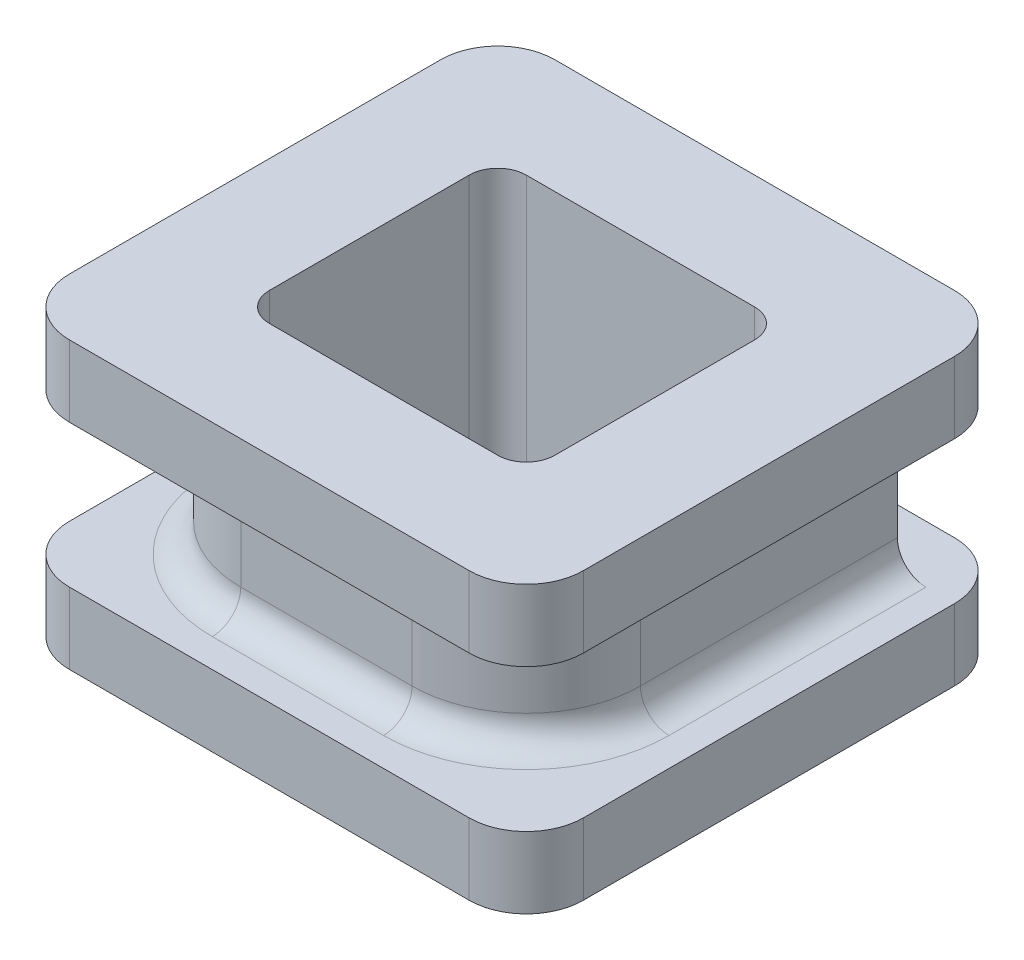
from build123d import *

# Parameters (mm, degrees)
SKETCH2_W           = 18
SKETCH2_H           = 17
SKETCH2_W_2         = 14
SKETCH2_H_2         = 13
SKETCH2_W_3         = 10
SKETCH2_H_3         = 9
BOSS_EXTRUDE1_DEPTH = 5
SKETCH2_5_W         = 18
SKETCH2_5_H         = 17
SKETCH2_5_W_2       = 14
SKETCH2_5_H_2       = 13
CUT_EXTRUDE2_DEPTH  = 2.5
FILLET1_R           = 4
FILLET2_R           = 1
FILLET3_R           = 2
FILLET4_R           = 1


with BuildPart() as part:
    # Sketch2 → Boss-Extrude1 (new, symmetric)
    # profile 1 of 2: a face of its own
    with BuildSketch(Plane(origin=(0, 0, 0), x_dir=(1, 0, 0), z_dir=(0, 1, 0))):
        with Locations((5, 4.5)):
            Rectangle(SKETCH2_W, SKETCH2_H)
        with Locations((5, 4.5)):
            Rectangle(SKETCH2_W_2, SKETCH2_H_2, mode=Mode.SUBTRACT)
    # profile 2 of 2: a face of its own
    with BuildSketch(Plane(origin=(0, 0, 0), x_dir=(1, 0, 0), z_dir=(0, 1, 0))):
        with Locations((5, 4.5)):
            Rectangle(SKETCH2_W_2, SKETCH2_H_2)
        with Locations((5, 4.5)):
            Rectangle(SKETCH2_W_3, SKETCH2_H_3, mode=Mode.SUBTRACT)
    extrude(amount=BOSS_EXTRUDE1_DEPTH, both=True)

    # Sketch2_5 → Cut-Extrude2 (cut, symmetric)
    with BuildSketch(Plane(origin=(0, 0, 0), x_dir=(1, 0, 0), z_dir=(0, 1, 0))):
        with Locations((5, 4.5)):
            Rectangle(SKETCH2_5_W, SKETCH2_5_H)
        with Locations((5, 4.5)):
            Rectangle(SKETCH2_5_W_2, SKETCH2_5_H_2, mode=Mode.SUBTRACT)
    extrude(amount=CUT_EXTRUDE2_DEPTH, both=True, mode=Mode.SUBTRACT)

    # Fillet1
    fillet1_edges = [part.edges().sort_by_distance(p)[0] for p in [
        (12, 0, 2),
        (-2, 0, 2),
    ]]
    fillet(fillet1_edges, radius=FILLET1_R)

    # Fillet2
    fillet2_edges = [part.edges().sort_by_distance(p)[0] for p in [
        (5, 2.5, 2),
        (5, -2.5, 2),
        (12, 2.5, -6.5),
        (12, -2.5, -6.5),
        (-2, 2.5, -6.5),
        (-2, -2.5, -6.5),
        (10.828427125, 2.5, 0.828427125),
        (10.828427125, -2.5, 0.828427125),
        (-0.828427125, 2.5, 0.828427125),
        (-0.828427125, -2.5, 0.828427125),
    ]]
    fillet(fillet2_edges, radius=FILLET2_R)

    # Fillet3
    fillet3_edges = [part.edges().sort_by_distance(p)[0] for p in [
        (14, 3.75, 4),
        (-4, 3.75, 4),
        (-4, 3.75, -13),
        (14, 3.75, -13),
        (14, -3.75, 4),
        (-4, -3.75, 4),
        (-4, -3.75, -13),
        (14, -3.75, -13),
    ]]
    fillet(fillet3_edges, radius=FILLET3_R)

    # Fillet4
    fillet4_edges = [part.edges().sort_by_distance(p)[0] for p in [
        (10, 0, -9),
        (0, 0, -9),
        (0, 0, 0),
        (10, 0, 0),
    ]]
    fillet(fillet4_edges, radius=FILLET4_R)


solid = part.part
